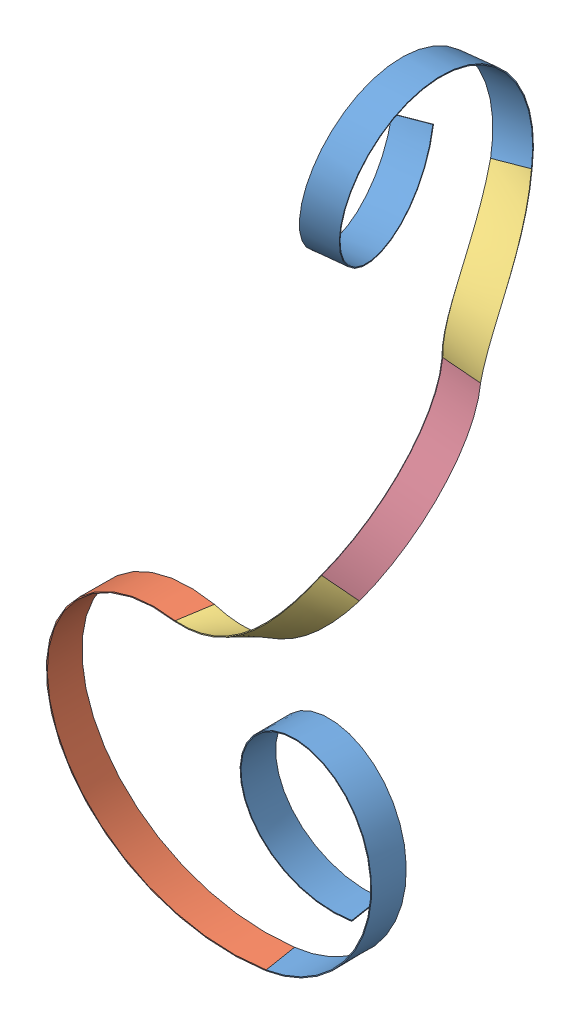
SolidWorks assembly achter2007.SLDASM, configuration Standard (file format 3400). Lengths in mm.
Overall size (220.83 447.4 225.71).
6 component instances, 4 part files, 15 mates.
Components (placement in the parent):
- L1-1: L1.SLDPRT [Standard] at origin size (101.34 101.34 69.75)
- L2-1: L2.SLDPRT [Standard] at (0 50 50) size (102.13 201.13 69.75)
- K45-1: K45.SLDPRT [Standard] at (0 200 100) x (-0.674883 0 -0.737925) z (0.737925 0 -0.674883) size (56.92 57.37 78.15)
- K4-1: K4.SLDPRT [Standard] at (35.1911 193.7732 34.2754) x (0.674883 0 0.737925) z (-0.577411 0.622677 0.528082) size (75 75 20)
- K45-2: K45.SLDPRT [Standard] at (32.2353 328.0662 -15.7603) x (0.459489 0.782479 -0.420234) z (0.872046 -0.487232 0.046276) size (56.92 57.37 78.15)
- L1-2: L1.SLDPRT [Standard] at (32.2353 328.0662 -15.7603) x (0.028961 -0.920938 0.388631) z (-0.985269 0.039255 0.166445) size (101.34 101.34 69.75)
Mates (geometry in assembly coordinates):
- Deckungsgleich1: coincident anti-aligned: plane of L1-1 through (1.5718 -49.75 59.8757) normal (-0.98757 0 0.157177); plane of L2-1 through (-1.5718 -49.75 40.1243) normal (0.98757 0 -0.157177)
- Deckungsgleich2: coincident aligned: line of L1-1; line of L2-1
- Deckungsgleich3: coincident aligned: line of L1-1; line of L2-1
- Deckungsgleich4: coincident anti-aligned: plane of L2-1 through (1.5718 149.75 90.1243) normal (0.98757 0 0.157177); plane of K45-1 through (-1.5718 150.25 109.8757) normal (-0.98757 0 -0.157177)
- Deckungsgleich5: coincident aligned: line of L2-1; line of K45-1
- Deckungsgleich6: coincident aligned: line of L2-1; line of K45-1
- Deckungsgleich7: coincident anti-aligned: plane of K45-1 through (73.9216 206.2268 99.8124) normal (0.459489 0.782479 -0.420234); plane of K4-1 through (74.2591 206.2268 100.1814) normal (-0.459489 -0.782479 0.420234)
- Deckungsgleich8: coincident anti-aligned: line of K45-1; line of K4-1
- Deckungsgleich9: coincident anti-aligned: line of K45-1; line of K4-1
- Deckungsgleich10: coincident anti-aligned: plane of K4-1 through (57.8748 264.5215 13.5296) normal (-0.674883 0 -0.737925); plane of K45-2 through (58.1045 264.9127 13.3194) normal (0.674883 0 0.737925)
- Deckungsgleich11: coincident aligned: line of K4-1; line of K45-2
- Deckungsgleich12: coincident anti-aligned: line of K4-1; line of K45-2
- Deckungsgleich13: coincident anti-aligned: plane of K45-2 through (14.1657 307.717 -58.5909) normal (-0.183462 0.915661 -0.357639); plane of L1-2 through (14.1657 307.717 -58.5909) normal (0.183462 -0.915661 0.357639)
- Deckungsgleich14: coincident anti-aligned: line of K45-2; line of L1-2
- Deckungsgleich15: coincident anti-aligned: line of K45-2; line of L1-2
